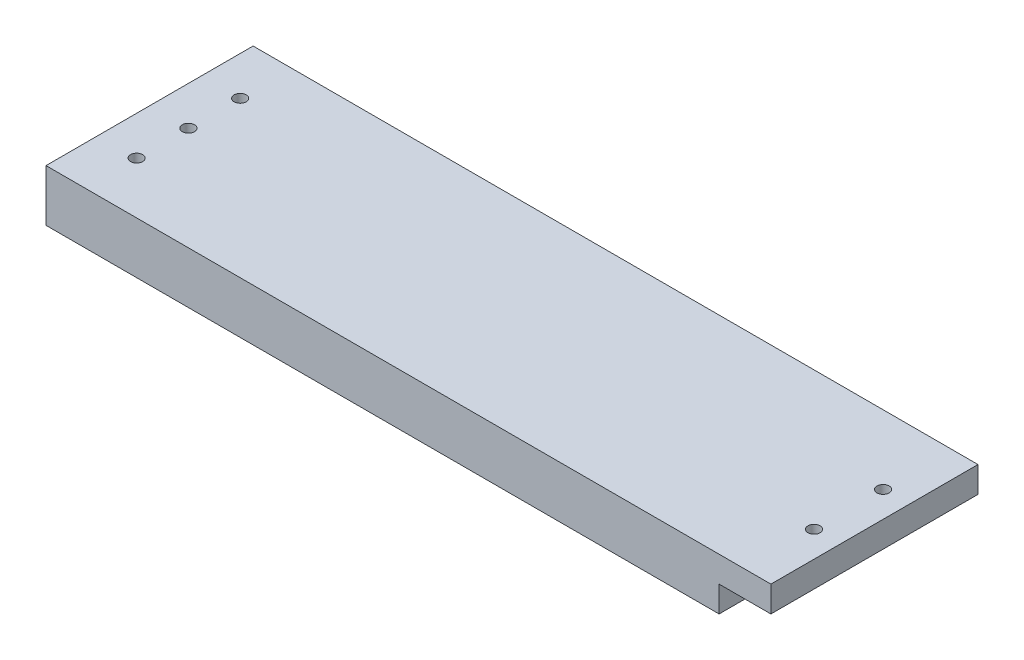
from build123d import *

# Parameters (mm, degrees)
SKETCH1_W           = 165.1
SKETCH1_H           = 50.8
BOSS_EXTRUDE1_DEPTH = 12.7
SKETCH2_R           = 1.49
CUT_EXTRUDE1_DEPTH  = 174.204907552
SKETCH3_W           = 50.8
SKETCH3_H           = 6.35
BOSS_EXTRUDE2_DEPTH = 12.7
SKETCH4_R           = 1.49
CUT_EXTRUDE2_DEPTH  = 186.023789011


with BuildPart() as part:
    # Sketch1 → Boss-Extrude1 (new body)
    with BuildSketch(Plane(origin=(0, 0, 0), x_dir=(1, 0, 0), z_dir=(0, 1, 0))):
        with Locations((82.55, -25.4)):
            Rectangle(SKETCH1_W, SKETCH1_H)
    extrude(amount=BOSS_EXTRUDE1_DEPTH)

    # Sketch2 → Cut-Extrude1 (cut, through all)
    with BuildSketch(Plane(origin=(0, 12.7, 0), x_dir=(1, 0, 0), z_dir=(0, 1, 0))):
        with Locations(Location((9.525, -12.7, 0), (0, 0, 270))):
            Circle(SKETCH2_R)
        with Locations(Location((9.525, -25.4, 0), (0, 0, 270))):
            Circle(SKETCH2_R)
        with Locations(Location((9.525, -38.1, 0), (0, 0, 270))):
            Circle(SKETCH2_R)
    extrude(amount=-CUT_EXTRUDE1_DEPTH, mode=Mode.SUBTRACT)

    # Sketch3 → Boss-Extrude2 (add)
    with BuildSketch(Plane(origin=(165.1, 0, 0), x_dir=(0, 0, -1), z_dir=(1, 0, 0))):
        with Locations((-25.4, 9.525)):
            Rectangle(SKETCH3_W, SKETCH3_H)
    extrude(amount=BOSS_EXTRUDE2_DEPTH)

    # Sketch4 → Cut-Extrude2 (cut, through all)
    with BuildSketch(Plane.XZ.offset(-6.35)):
        with Locations(Location((171.45, 33.866666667, 0), (0, 0, 270))):
            Circle(SKETCH4_R)
        with Locations(Location((171.45, 16.933333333, 0), (0, 0, 270))):
            Circle(SKETCH4_R)
    extrude(amount=-CUT_EXTRUDE2_DEPTH, mode=Mode.SUBTRACT)


solid = part.part
